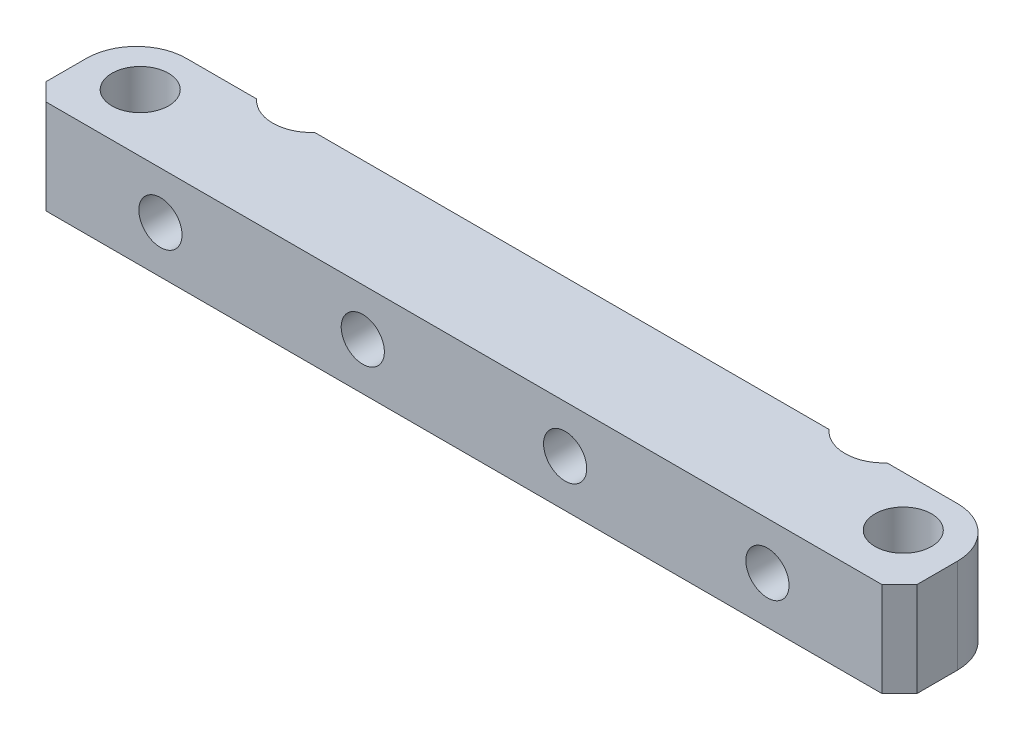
ISO-10303-21;
HEADER;
FILE_DESCRIPTION(('STEP AP214'),'2;1');
FILE_NAME('part.step','',(''),(''),'','','');
FILE_SCHEMA(('AUTOMOTIVE_DESIGN { 1 0 10303 214 1 1 1 1 }'));
ENDSEC;
DATA;
#1=APPLICATION_CONTEXT('core data for automotive mechanical design processes');
#2=APPLICATION_PROTOCOL_DEFINITION('international standard','automotive_design',2000,#1);
#3=PRODUCT_CONTEXT('',#1,'mechanical');
#4=PRODUCT('Part','Part','',(#3));
#5=PRODUCT_RELATED_PRODUCT_CATEGORY('part','',(#4));
#6=PRODUCT_DEFINITION_FORMATION('','',#4);
#7=PRODUCT_DEFINITION_CONTEXT('part definition',#1,'design');
#8=PRODUCT_DEFINITION('design','',#6,#7);
#9=PRODUCT_DEFINITION_SHAPE('','',#8);
#10=(LENGTH_UNIT() NAMED_UNIT(*) SI_UNIT(.MILLI.,.METRE.));
#11=(NAMED_UNIT(*) PLANE_ANGLE_UNIT() SI_UNIT($,.RADIAN.));
#12=(NAMED_UNIT(*) SI_UNIT($,.STERADIAN.) SOLID_ANGLE_UNIT());
#13=UNCERTAINTY_MEASURE_WITH_UNIT(LENGTH_MEASURE(1.E-05),#10,'distance_accuracy_value','');
#14=(GEOMETRIC_REPRESENTATION_CONTEXT(3) GLOBAL_UNCERTAINTY_ASSIGNED_CONTEXT((#13)) GLOBAL_UNIT_ASSIGNED_CONTEXT((#10,
#11,#12)) REPRESENTATION_CONTEXT('',''));
#15=CARTESIAN_POINT('',(0.,0.,0.));
#16=DIRECTION('',(0.,0.,1.));
#17=DIRECTION('',(1.,0.,0.));
#18=AXIS2_PLACEMENT_3D('',#15,#16,#17);
#19=CARTESIAN_POINT('',(-32.284271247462,7.,-32.));
#20=DIRECTION('',(0.,0.,1.));
#21=DIRECTION('',(1.,0.,0.));
#22=AXIS2_PLACEMENT_3D('',#19,#20,#21);
#23=PLANE('',#22);
#24=CARTESIAN_POINT('',(7.5,3.5,-32.));
#25=DIRECTION('',(0.,0.,1.));
#26=DIRECTION('',(1.,0.,0.));
#27=AXIS2_PLACEMENT_3D('',#24,#25,#26);
#28=CIRCLE('',#27,1.6);
#29=CARTESIAN_POINT('',(9.1,3.5,-32.));
#30=VERTEX_POINT('',#29);
#31=EDGE_CURVE('E238',#30,#30,#28,.T.);
#32=ORIENTED_EDGE('',*,*,#31,.T.);
#33=EDGE_LOOP('',(#32));
#34=FACE_BOUND('',#33,.T.);
#35=CARTESIAN_POINT('',(-7.5,3.5,-32.));
#36=DIRECTION('',(0.,0.,1.));
#37=DIRECTION('',(1.,0.,0.));
#38=AXIS2_PLACEMENT_3D('',#35,#36,#37);
#39=CIRCLE('',#38,1.6);
#40=CARTESIAN_POINT('',(-5.9,3.5,-32.));
#41=VERTEX_POINT('',#40);
#42=EDGE_CURVE('E246',#41,#41,#39,.T.);
#43=ORIENTED_EDGE('',*,*,#42,.T.);
#44=EDGE_LOOP('',(#43));
#45=FACE_BOUND('',#44,.T.);
#46=DIRECTION('',(-1.,0.,0.));
#47=VECTOR('',#46,1.);
#48=CARTESIAN_POINT('',(-32.284271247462,7.,-32.));
#49=LINE('',#48,#47);
#50=CARTESIAN_POINT('',(19.0586659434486,7.,-32.));
#51=VERTEX_POINT('',#50);
#52=CARTESIAN_POINT('',(-19.0586659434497,7.,-32.));
#53=VERTEX_POINT('',#52);
#54=EDGE_CURVE('E184',#51,#53,#49,.T.);
#55=ORIENTED_EDGE('',*,*,#54,.F.);
#56=DIRECTION('',(0.,-1.,0.));
#57=VECTOR('',#56,1.);
#58=CARTESIAN_POINT('',(19.0586659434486,7.,-32.));
#59=LINE('',#58,#57);
#60=CARTESIAN_POINT('',(19.0586659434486,0.,-32.));
#61=VERTEX_POINT('',#60);
#62=EDGE_CURVE('E156',#51,#61,#59,.T.);
#63=ORIENTED_EDGE('',*,*,#62,.T.);
#64=DIRECTION('',(-1.,0.,0.));
#65=VECTOR('',#64,1.);
#66=CARTESIAN_POINT('',(-32.284271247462,0.,-32.));
#67=LINE('',#66,#65);
#68=CARTESIAN_POINT('',(-19.0586659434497,0.,-32.));
#69=VERTEX_POINT('',#68);
#70=EDGE_CURVE('E296',#61,#69,#67,.T.);
#71=ORIENTED_EDGE('',*,*,#70,.T.);
#72=DIRECTION('',(0.,-1.,0.));
#73=VECTOR('',#72,1.);
#74=CARTESIAN_POINT('',(-19.0586659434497,7.,-32.));
#75=LINE('',#74,#73);
#76=EDGE_CURVE('E262',#69,#53,#75,.F.);
#77=ORIENTED_EDGE('',*,*,#76,.T.);
#78=EDGE_LOOP('',(#55,#63,#71,#77));
#79=FACE_BOUND('',#78,.T.);
#80=ADVANCED_FACE('F47',(#34,#45,#79),#23,.F.);
#81=CARTESIAN_POINT('',(-23.3677409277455,7.,-32.));
#82=VERTEX_POINT('',#81);
#83=CARTESIAN_POINT('',(-28.584271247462,7.,-32.));
#84=VERTEX_POINT('',#83);
#85=EDGE_CURVE('E186',#82,#84,#49,.T.);
#86=ORIENTED_EDGE('',*,*,#85,.F.);
#87=DIRECTION('',(0.,-1.,0.));
#88=VECTOR('',#87,1.);
#89=CARTESIAN_POINT('',(-23.3677409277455,7.,-32.));
#90=LINE('',#89,#88);
#91=CARTESIAN_POINT('',(-23.3677409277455,6.26713311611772,-32.));
#92=VERTEX_POINT('',#91);
#93=EDGE_CURVE('E276',#82,#92,#90,.T.);
#94=ORIENTED_EDGE('',*,*,#93,.T.);
#95=CARTESIAN_POINT('',(-22.5,3.5,-32.));
#96=DIRECTION('',(0.,0.,-1.));
#97=DIRECTION('',(-1.,0.,0.));
#98=AXIS2_PLACEMENT_3D('',#95,#96,#97);
#99=CIRCLE('',#98,2.9);
#100=CARTESIAN_POINT('',(-23.3677409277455,0.732866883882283,-32.));
#101=VERTEX_POINT('',#100);
#102=EDGE_CURVE('E261',#101,#92,#99,.T.);
#103=ORIENTED_EDGE('',*,*,#102,.F.);
#104=CARTESIAN_POINT('',(-23.3677409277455,0.,-32.));
#105=VERTEX_POINT('',#104);
#106=EDGE_CURVE('E70',#101,#105,#90,.T.);
#107=ORIENTED_EDGE('',*,*,#106,.T.);
#108=CARTESIAN_POINT('',(-28.584271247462,0.,-32.));
#109=VERTEX_POINT('',#108);
#110=EDGE_CURVE('E302',#105,#109,#67,.T.);
#111=ORIENTED_EDGE('',*,*,#110,.T.);
#112=DIRECTION('',(0.,-1.,0.));
#113=VECTOR('',#112,1.);
#114=CARTESIAN_POINT('',(-28.584271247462,7.,-32.));
#115=LINE('',#114,#113);
#116=EDGE_CURVE('E321',#109,#84,#115,.F.);
#117=ORIENTED_EDGE('',*,*,#116,.T.);
#118=EDGE_LOOP('',(#86,#94,#103,#107,#111,#117));
#119=FACE_BOUND('',#118,.T.);
#120=ADVANCED_FACE('F384',(#119),#23,.F.);
#121=CARTESIAN_POINT('',(22.5,3.5,-32.));
#122=DIRECTION('',(0.,0.,1.));
#123=DIRECTION('',(1.,0.,0.));
#124=AXIS2_PLACEMENT_3D('',#121,#122,#123);
#125=CYLINDRICAL_SURFACE('',#124,1.6);
#126=CARTESIAN_POINT('',(22.5,3.5,-24.));
#127=DIRECTION('',(0.,0.,1.));
#128=DIRECTION('',(1.,0.,0.));
#129=AXIS2_PLACEMENT_3D('',#126,#127,#128);
#130=CIRCLE('',#129,1.6);
#131=CARTESIAN_POINT('',(24.1,3.5,-24.));
#132=VERTEX_POINT('',#131);
#133=EDGE_CURVE('E234',#132,#132,#130,.T.);
#134=ORIENTED_EDGE('',*,*,#133,.T.);
#135=EDGE_LOOP('',(#134));
#136=FACE_BOUND('',#135,.T.);
#137=CARTESIAN_POINT('',(22.5,3.5,-28.5));
#138=DIRECTION('',(0.,0.,-1.));
#139=DIRECTION('',(-1.,0.,0.));
#140=AXIS2_PLACEMENT_3D('',#137,#138,#139);
#141=CIRCLE('',#140,1.6);
#142=CARTESIAN_POINT('',(20.9,3.5,-28.5));
#143=VERTEX_POINT('',#142);
#144=EDGE_CURVE('E239',#143,#143,#141,.F.);
#145=ORIENTED_EDGE('',*,*,#144,.F.);
#146=EDGE_LOOP('',(#145));
#147=FACE_BOUND('',#146,.T.);
#148=ADVANCED_FACE('F389',(#136,#147),#125,.F.);
#149=CARTESIAN_POINT('',(-22.5,3.5,-32.));
#150=DIRECTION('',(0.,0.,1.));
#151=DIRECTION('',(1.,0.,0.));
#152=AXIS2_PLACEMENT_3D('',#149,#150,#151);
#153=CYLINDRICAL_SURFACE('',#152,1.6);
#154=CARTESIAN_POINT('',(-22.5,3.5,-24.));
#155=DIRECTION('',(0.,0.,1.));
#156=DIRECTION('',(1.,0.,0.));
#157=AXIS2_PLACEMENT_3D('',#154,#155,#156);
#158=CIRCLE('',#157,1.6);
#159=CARTESIAN_POINT('',(-20.9,3.5,-24.));
#160=VERTEX_POINT('',#159);
#161=EDGE_CURVE('E230',#160,#160,#158,.T.);
#162=ORIENTED_EDGE('',*,*,#161,.T.);
#163=EDGE_LOOP('',(#162));
#164=FACE_BOUND('',#163,.T.);
#165=CARTESIAN_POINT('',(-22.5,3.5,-28.5));
#166=DIRECTION('',(0.,0.,-1.));
#167=DIRECTION('',(-1.,0.,0.));
#168=AXIS2_PLACEMENT_3D('',#165,#166,#167);
#169=CIRCLE('',#168,1.6);
#170=CARTESIAN_POINT('',(-24.1,3.5,-28.5));
#171=VERTEX_POINT('',#170);
#172=EDGE_CURVE('E272',#171,#171,#169,.F.);
#173=ORIENTED_EDGE('',*,*,#172,.F.);
#174=EDGE_LOOP('',(#173));
#175=FACE_BOUND('',#174,.T.);
#176=ADVANCED_FACE('F470',(#164,#175),#153,.F.);
#177=CARTESIAN_POINT('',(0.,7.,0.));
#178=DIRECTION('',(0.,1.,0.));
#179=DIRECTION('',(0.,0.,1.));
#180=AXIS2_PLACEMENT_3D('',#177,#178,#179);
#181=PLANE('',#180);
#182=CARTESIAN_POINT('',(21.2132034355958,7.,-33.9411254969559));
#183=DIRECTION('',(0.,-1.,0.));
#184=DIRECTION('',(0.,0.,-1.));
#185=AXIS2_PLACEMENT_3D('',#182,#183,#184);
#186=CIRCLE('',#185,2.9);
#187=CARTESIAN_POINT('',(23.367740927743,7.,-32.));
#188=VERTEX_POINT('',#187);
#189=EDGE_CURVE('E153',#188,#51,#186,.T.);
#190=ORIENTED_EDGE('',*,*,#189,.T.);
#191=ORIENTED_EDGE('',*,*,#54,.T.);
#192=CARTESIAN_POINT('',(-21.2132034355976,7.,-33.9411254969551));
#193=DIRECTION('',(0.,-1.,0.));
#194=DIRECTION('',(0.,0.,-1.));
#195=AXIS2_PLACEMENT_3D('',#192,#193,#194);
#196=CIRCLE('',#195,2.9);
#197=EDGE_CURVE('E281',#53,#82,#196,.T.);
#198=ORIENTED_EDGE('',*,*,#197,.T.);
#199=ORIENTED_EDGE('',*,*,#85,.T.);
#200=CARTESIAN_POINT('',(-28.584271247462,7.,-28.3));
#201=DIRECTION('',(0.,1.,0.));
#202=DIRECTION('',(0.,0.,1.));
#203=AXIS2_PLACEMENT_3D('',#200,#201,#202);
#204=CIRCLE('',#203,3.7);
#205=CARTESIAN_POINT('',(-32.284271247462,7.,-28.3));
#206=VERTEX_POINT('',#205);
#207=EDGE_CURVE('E326',#84,#206,#204,.T.);
#208=ORIENTED_EDGE('',*,*,#207,.T.);
#209=DIRECTION('',(0.,0.,1.));
#210=VECTOR('',#209,1.);
#211=CARTESIAN_POINT('',(-32.284271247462,7.,-32.));
#212=LINE('',#211,#210);
#213=CARTESIAN_POINT('',(-32.284271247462,7.,-25.3));
#214=VERTEX_POINT('',#213);
#215=EDGE_CURVE('E209',#206,#214,#212,.T.);
#216=ORIENTED_EDGE('',*,*,#215,.T.);
#217=DIRECTION('',(-0.707106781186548,0.,-0.707106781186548));
#218=VECTOR('',#217,1.);
#219=CARTESIAN_POINT('',(-3.49213562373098,7.,3.49213562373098));
#220=LINE('',#219,#218);
#221=CARTESIAN_POINT('',(-30.984271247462,7.,-24.));
#222=VERTEX_POINT('',#221);
#223=EDGE_CURVE('E348',#214,#222,#220,.F.);
#224=ORIENTED_EDGE('',*,*,#223,.T.);
#225=DIRECTION('',(1.,0.,0.));
#226=VECTOR('',#225,1.);
#227=CARTESIAN_POINT('',(-32.284271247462,7.,-24.));
#228=LINE('',#227,#226);
#229=CARTESIAN_POINT('',(30.9842712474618,7.,-24.));
#230=VERTEX_POINT('',#229);
#231=EDGE_CURVE('E202',#222,#230,#228,.T.);
#232=ORIENTED_EDGE('',*,*,#231,.T.);
#233=DIRECTION('',(-0.707106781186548,0.,0.707106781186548));
#234=VECTOR('',#233,1.);
#235=CARTESIAN_POINT('',(3.49213562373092,7.,3.49213562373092));
#236=LINE('',#235,#234);
#237=CARTESIAN_POINT('',(32.2842712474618,7.,-25.3));
#238=VERTEX_POINT('',#237);
#239=EDGE_CURVE('E345',#230,#238,#236,.F.);
#240=ORIENTED_EDGE('',*,*,#239,.T.);
#241=DIRECTION('',(0.,0.,-1.));
#242=VECTOR('',#241,1.);
#243=CARTESIAN_POINT('',(32.2842712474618,7.,-32.));
#244=LINE('',#243,#242);
#245=CARTESIAN_POINT('',(32.2842712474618,7.,-28.3));
#246=VERTEX_POINT('',#245);
#247=EDGE_CURVE('E195',#238,#246,#244,.T.);
#248=ORIENTED_EDGE('',*,*,#247,.T.);
#249=CARTESIAN_POINT('',(28.5842712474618,7.,-28.3));
#250=DIRECTION('',(0.,1.,0.));
#251=DIRECTION('',(0.,0.,1.));
#252=AXIS2_PLACEMENT_3D('',#249,#250,#251);
#253=CIRCLE('',#252,3.7);
#254=CARTESIAN_POINT('',(28.5842712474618,7.,-32.));
#255=VERTEX_POINT('',#254);
#256=EDGE_CURVE('E181',#246,#255,#253,.T.);
#257=ORIENTED_EDGE('',*,*,#256,.T.);
#258=EDGE_CURVE('E170',#255,#188,#49,.T.);
#259=ORIENTED_EDGE('',*,*,#258,.T.);
#260=EDGE_LOOP('',(#190,#191,#198,#199,#208,#216,#224,#232,#240,#248,#257,#259));
#261=FACE_BOUND('',#260,.T.);
#262=CARTESIAN_POINT('',(28.2842712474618,7.,-28.284271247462));
#263=DIRECTION('',(0.,1.,0.));
#264=DIRECTION('',(0.,0.,1.));
#265=AXIS2_PLACEMENT_3D('',#262,#263,#264);
#266=CIRCLE('',#265,2.1);
#267=CARTESIAN_POINT('',(28.2842712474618,7.,-26.184271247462));
#268=VERTEX_POINT('',#267);
#269=EDGE_CURVE('E220',#268,#268,#266,.T.);
#270=ORIENTED_EDGE('',*,*,#269,.F.);
#271=EDGE_LOOP('',(#270));
#272=FACE_BOUND('',#271,.T.);
#273=CARTESIAN_POINT('',(-28.284271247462,7.,-28.2842712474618));
#274=DIRECTION('',(0.,1.,0.));
#275=DIRECTION('',(0.,0.,1.));
#276=AXIS2_PLACEMENT_3D('',#273,#274,#275);
#277=CIRCLE('',#276,2.1);
#278=CARTESIAN_POINT('',(-28.284271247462,7.,-26.1842712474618));
#279=VERTEX_POINT('',#278);
#280=EDGE_CURVE('E221',#279,#279,#277,.T.);
#281=ORIENTED_EDGE('',*,*,#280,.F.);
#282=EDGE_LOOP('',(#281));
#283=FACE_BOUND('',#282,.T.);
#284=ADVANCED_FACE('F178',(#261,#272,#283),#181,.T.);
#285=CARTESIAN_POINT('',(0.,0.,0.));
#286=DIRECTION('',(0.,1.,0.));
#287=DIRECTION('',(0.,0.,1.));
#288=AXIS2_PLACEMENT_3D('',#285,#286,#287);
#289=PLANE('',#288);
#290=ORIENTED_EDGE('',*,*,#70,.F.);
#291=CARTESIAN_POINT('',(21.2132034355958,0.,-33.9411254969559));
#292=DIRECTION('',(0.,-1.,0.));
#293=DIRECTION('',(0.,0.,-1.));
#294=AXIS2_PLACEMENT_3D('',#291,#292,#293);
#295=CIRCLE('',#294,2.9);
#296=CARTESIAN_POINT('',(23.367740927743,0.,-32.));
#297=VERTEX_POINT('',#296);
#298=EDGE_CURVE('E162',#297,#61,#295,.T.);
#299=ORIENTED_EDGE('',*,*,#298,.F.);
#300=CARTESIAN_POINT('',(28.5842712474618,0.,-32.));
#301=VERTEX_POINT('',#300);
#302=EDGE_CURVE('E215',#301,#297,#67,.T.);
#303=ORIENTED_EDGE('',*,*,#302,.F.);
#304=CARTESIAN_POINT('',(28.5842712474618,0.,-28.3));
#305=DIRECTION('',(0.,1.,0.));
#306=DIRECTION('',(0.,0.,1.));
#307=AXIS2_PLACEMENT_3D('',#304,#305,#306);
#308=CIRCLE('',#307,3.7);
#309=CARTESIAN_POINT('',(32.2842712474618,0.,-28.3));
#310=VERTEX_POINT('',#309);
#311=EDGE_CURVE('E189',#301,#310,#308,.F.);
#312=ORIENTED_EDGE('',*,*,#311,.T.);
#313=DIRECTION('',(0.,0.,-1.));
#314=VECTOR('',#313,1.);
#315=CARTESIAN_POINT('',(32.2842712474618,0.,-32.));
#316=LINE('',#315,#314);
#317=CARTESIAN_POINT('',(32.2842712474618,0.,-25.3));
#318=VERTEX_POINT('',#317);
#319=EDGE_CURVE('E307',#318,#310,#316,.T.);
#320=ORIENTED_EDGE('',*,*,#319,.F.);
#321=DIRECTION('',(0.707106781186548,0.,-0.707106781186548));
#322=VECTOR('',#321,1.);
#323=CARTESIAN_POINT('',(32.2842712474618,0.,-25.3));
#324=LINE('',#323,#322);
#325=CARTESIAN_POINT('',(30.9842712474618,0.,-24.));
#326=VERTEX_POINT('',#325);
#327=EDGE_CURVE('E337',#318,#326,#324,.F.);
#328=ORIENTED_EDGE('',*,*,#327,.T.);
#329=DIRECTION('',(1.,0.,0.));
#330=VECTOR('',#329,1.);
#331=CARTESIAN_POINT('',(-32.284271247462,0.,-24.));
#332=LINE('',#331,#330);
#333=CARTESIAN_POINT('',(-30.984271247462,0.,-24.));
#334=VERTEX_POINT('',#333);
#335=EDGE_CURVE('E445',#334,#326,#332,.T.);
#336=ORIENTED_EDGE('',*,*,#335,.F.);
#337=DIRECTION('',(0.707106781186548,0.,0.707106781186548));
#338=VECTOR('',#337,1.);
#339=CARTESIAN_POINT('',(-30.984271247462,0.,-24.));
#340=LINE('',#339,#338);
#341=CARTESIAN_POINT('',(-32.284271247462,0.,-25.3));
#342=VERTEX_POINT('',#341);
#343=EDGE_CURVE('E340',#334,#342,#340,.F.);
#344=ORIENTED_EDGE('',*,*,#343,.T.);
#345=DIRECTION('',(0.,0.,1.));
#346=VECTOR('',#345,1.);
#347=CARTESIAN_POINT('',(-32.284271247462,0.,-32.));
#348=LINE('',#347,#346);
#349=CARTESIAN_POINT('',(-32.284271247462,0.,-28.3));
#350=VERTEX_POINT('',#349);
#351=EDGE_CURVE('E225',#350,#342,#348,.T.);
#352=ORIENTED_EDGE('',*,*,#351,.F.);
#353=CARTESIAN_POINT('',(-28.584271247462,0.,-28.3));
#354=DIRECTION('',(0.,1.,0.));
#355=DIRECTION('',(0.,0.,1.));
#356=AXIS2_PLACEMENT_3D('',#353,#354,#355);
#357=CIRCLE('',#356,3.7);
#358=EDGE_CURVE('E314',#350,#109,#357,.F.);
#359=ORIENTED_EDGE('',*,*,#358,.T.);
#360=ORIENTED_EDGE('',*,*,#110,.F.);
#361=CARTESIAN_POINT('',(-21.2132034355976,0.,-33.9411254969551));
#362=DIRECTION('',(0.,-1.,0.));
#363=DIRECTION('',(0.,0.,-1.));
#364=AXIS2_PLACEMENT_3D('',#361,#362,#363);
#365=CIRCLE('',#364,2.9);
#366=EDGE_CURVE('E284',#69,#105,#365,.T.);
#367=ORIENTED_EDGE('',*,*,#366,.F.);
#368=EDGE_LOOP('',(#290,#299,#303,#312,#320,#328,#336,#344,#352,#359,#360,#367));
#369=FACE_BOUND('',#368,.T.);
#370=CARTESIAN_POINT('',(28.2842712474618,0.,-28.284271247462));
#371=DIRECTION('',(0.,1.,0.));
#372=DIRECTION('',(0.,0.,1.));
#373=AXIS2_PLACEMENT_3D('',#370,#371,#372);
#374=CIRCLE('',#373,2.1);
#375=CARTESIAN_POINT('',(28.2842712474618,0.,-26.184271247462));
#376=VERTEX_POINT('',#375);
#377=EDGE_CURVE('E216',#376,#376,#374,.T.);
#378=ORIENTED_EDGE('',*,*,#377,.T.);
#379=EDGE_LOOP('',(#378));
#380=FACE_BOUND('',#379,.T.);
#381=CARTESIAN_POINT('',(-28.284271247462,0.,-28.2842712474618));
#382=DIRECTION('',(0.,1.,0.));
#383=DIRECTION('',(0.,0.,1.));
#384=AXIS2_PLACEMENT_3D('',#381,#382,#383);
#385=CIRCLE('',#384,2.1);
#386=CARTESIAN_POINT('',(-28.284271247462,0.,-26.1842712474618));
#387=VERTEX_POINT('',#386);
#388=EDGE_CURVE('E226',#387,#387,#385,.T.);
#389=ORIENTED_EDGE('',*,*,#388,.T.);
#390=EDGE_LOOP('',(#389));
#391=FACE_BOUND('',#390,.T.);
#392=ADVANCED_FACE('F298',(#369,#380,#391),#289,.F.);
#393=CARTESIAN_POINT('',(-32.284271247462,7.,-32.));
#394=DIRECTION('',(1.,0.,0.));
#395=DIRECTION('',(0.,0.,-1.));
#396=AXIS2_PLACEMENT_3D('',#393,#394,#395);
#397=PLANE('',#396);
#398=ORIENTED_EDGE('',*,*,#351,.T.);
#399=DIRECTION('',(0.,1.,0.));
#400=VECTOR('',#399,1.);
#401=CARTESIAN_POINT('',(-32.284271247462,7.,-25.3));
#402=LINE('',#401,#400);
#403=EDGE_CURVE('E343',#342,#214,#402,.T.);
#404=ORIENTED_EDGE('',*,*,#403,.T.);
#405=ORIENTED_EDGE('',*,*,#215,.F.);
#406=DIRECTION('',(0.,-1.,0.));
#407=VECTOR('',#406,1.);
#408=CARTESIAN_POINT('',(-32.284271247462,7.,-28.3));
#409=LINE('',#408,#407);
#410=EDGE_CURVE('E183',#206,#350,#409,.T.);
#411=ORIENTED_EDGE('',*,*,#410,.T.);
#412=EDGE_LOOP('',(#398,#404,#405,#411));
#413=FACE_BOUND('',#412,.T.);
#414=ADVANCED_FACE('F407',(#413),#397,.F.);
#415=CARTESIAN_POINT('',(-32.284271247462,7.,-24.));
#416=DIRECTION('',(0.,0.,-1.));
#417=DIRECTION('',(-1.,0.,0.));
#418=AXIS2_PLACEMENT_3D('',#415,#416,#417);
#419=PLANE('',#418);
#420=ORIENTED_EDGE('',*,*,#161,.F.);
#421=EDGE_LOOP('',(#420));
#422=FACE_BOUND('',#421,.T.);
#423=CARTESIAN_POINT('',(-7.5,3.5,-24.));
#424=DIRECTION('',(0.,0.,1.));
#425=DIRECTION('',(1.,0.,0.));
#426=AXIS2_PLACEMENT_3D('',#423,#424,#425);
#427=CIRCLE('',#426,1.6);
#428=CARTESIAN_POINT('',(-5.9,3.5,-24.));
#429=VERTEX_POINT('',#428);
#430=EDGE_CURVE('E250',#429,#429,#427,.T.);
#431=ORIENTED_EDGE('',*,*,#430,.F.);
#432=EDGE_LOOP('',(#431));
#433=FACE_BOUND('',#432,.T.);
#434=CARTESIAN_POINT('',(7.5,3.5,-24.));
#435=DIRECTION('',(0.,0.,1.));
#436=DIRECTION('',(1.,0.,0.));
#437=AXIS2_PLACEMENT_3D('',#434,#435,#436);
#438=CIRCLE('',#437,1.6);
#439=CARTESIAN_POINT('',(9.1,3.5,-24.));
#440=VERTEX_POINT('',#439);
#441=EDGE_CURVE('E242',#440,#440,#438,.T.);
#442=ORIENTED_EDGE('',*,*,#441,.F.);
#443=EDGE_LOOP('',(#442));
#444=FACE_BOUND('',#443,.T.);
#445=ORIENTED_EDGE('',*,*,#133,.F.);
#446=EDGE_LOOP('',(#445));
#447=FACE_BOUND('',#446,.T.);
#448=ORIENTED_EDGE('',*,*,#231,.F.);
#449=DIRECTION('',(0.,-1.,0.));
#450=VECTOR('',#449,1.);
#451=CARTESIAN_POINT('',(-30.984271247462,7.,-24.));
#452=LINE('',#451,#450);
#453=EDGE_CURVE('E333',#222,#334,#452,.T.);
#454=ORIENTED_EDGE('',*,*,#453,.T.);
#455=ORIENTED_EDGE('',*,*,#335,.T.);
#456=DIRECTION('',(0.,1.,0.));
#457=VECTOR('',#456,1.);
#458=CARTESIAN_POINT('',(30.9842712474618,7.,-24.));
#459=LINE('',#458,#457);
#460=EDGE_CURVE('E331',#326,#230,#459,.T.);
#461=ORIENTED_EDGE('',*,*,#460,.T.);
#462=EDGE_LOOP('',(#448,#454,#455,#461));
#463=FACE_BOUND('',#462,.T.);
#464=ADVANCED_FACE('F403',(#422,#433,#444,#447,#463),#419,.F.);
#465=CARTESIAN_POINT('',(32.2842712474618,7.,-32.));
#466=DIRECTION('',(-1.,0.,0.));
#467=DIRECTION('',(0.,0.,1.));
#468=AXIS2_PLACEMENT_3D('',#465,#466,#467);
#469=PLANE('',#468);
#470=ORIENTED_EDGE('',*,*,#247,.F.);
#471=DIRECTION('',(0.,-1.,0.));
#472=VECTOR('',#471,1.);
#473=CARTESIAN_POINT('',(32.2842712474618,7.,-25.3));
#474=LINE('',#473,#472);
#475=EDGE_CURVE('E351',#238,#318,#474,.T.);
#476=ORIENTED_EDGE('',*,*,#475,.T.);
#477=ORIENTED_EDGE('',*,*,#319,.T.);
#478=DIRECTION('',(0.,-1.,0.));
#479=VECTOR('',#478,1.);
#480=CARTESIAN_POINT('',(32.2842712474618,7.,-28.3));
#481=LINE('',#480,#479);
#482=EDGE_CURVE('E328',#310,#246,#481,.F.);
#483=ORIENTED_EDGE('',*,*,#482,.T.);
#484=EDGE_LOOP('',(#470,#476,#477,#483));
#485=FACE_BOUND('',#484,.T.);
#486=ADVANCED_FACE('F396',(#485),#469,.F.);
#487=ORIENTED_EDGE('',*,*,#302,.T.);
#488=DIRECTION('',(0.,-1.,0.));
#489=VECTOR('',#488,1.);
#490=CARTESIAN_POINT('',(23.367740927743,7.,-32.));
#491=LINE('',#490,#489);
#492=CARTESIAN_POINT('',(23.367740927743,0.73286688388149,-32.));
#493=VERTEX_POINT('',#492);
#494=EDGE_CURVE('E176',#297,#493,#491,.F.);
#495=ORIENTED_EDGE('',*,*,#494,.T.);
#496=CARTESIAN_POINT('',(22.5,3.5,-32.));
#497=DIRECTION('',(0.,0.,-1.));
#498=DIRECTION('',(-1.,0.,0.));
#499=AXIS2_PLACEMENT_3D('',#496,#497,#498);
#500=CIRCLE('',#499,2.9);
#501=CARTESIAN_POINT('',(23.367740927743,6.26713311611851,-32.));
#502=VERTEX_POINT('',#501);
#503=EDGE_CURVE('E174',#502,#493,#500,.T.);
#504=ORIENTED_EDGE('',*,*,#503,.F.);
#505=EDGE_CURVE('E77',#502,#188,#491,.F.);
#506=ORIENTED_EDGE('',*,*,#505,.T.);
#507=ORIENTED_EDGE('',*,*,#258,.F.);
#508=DIRECTION('',(0.,-1.,0.));
#509=VECTOR('',#508,1.);
#510=CARTESIAN_POINT('',(28.5842712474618,7.,-32.));
#511=LINE('',#510,#509);
#512=EDGE_CURVE('E318',#255,#301,#511,.T.);
#513=ORIENTED_EDGE('',*,*,#512,.T.);
#514=EDGE_LOOP('',(#487,#495,#504,#506,#507,#513));
#515=FACE_BOUND('',#514,.T.);
#516=ADVANCED_FACE('F168',(#515),#23,.F.);
#517=CARTESIAN_POINT('',(28.2842712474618,7.,-28.284271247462));
#518=DIRECTION('',(0.,-1.,0.));
#519=DIRECTION('',(0.,0.,-1.));
#520=AXIS2_PLACEMENT_3D('',#517,#518,#519);
#521=CYLINDRICAL_SURFACE('',#520,2.1);
#522=ORIENTED_EDGE('',*,*,#269,.T.);
#523=EDGE_LOOP('',(#522));
#524=FACE_BOUND('',#523,.T.);
#525=ORIENTED_EDGE('',*,*,#377,.F.);
#526=EDGE_LOOP('',(#525));
#527=FACE_BOUND('',#526,.T.);
#528=ADVANCED_FACE('F395',(#524,#527),#521,.F.);
#529=CARTESIAN_POINT('',(-28.284271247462,7.,-28.2842712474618));
#530=DIRECTION('',(0.,-1.,0.));
#531=DIRECTION('',(0.,0.,-1.));
#532=AXIS2_PLACEMENT_3D('',#529,#530,#531);
#533=CYLINDRICAL_SURFACE('',#532,2.1);
#534=ORIENTED_EDGE('',*,*,#280,.T.);
#535=EDGE_LOOP('',(#534));
#536=FACE_BOUND('',#535,.T.);
#537=ORIENTED_EDGE('',*,*,#388,.F.);
#538=EDGE_LOOP('',(#537));
#539=FACE_BOUND('',#538,.T.);
#540=ADVANCED_FACE('F400',(#536,#539),#533,.F.);
#541=CARTESIAN_POINT('',(-28.584271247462,7.,-28.3));
#542=DIRECTION('',(0.,-1.,0.));
#543=DIRECTION('',(0.,0.,-1.));
#544=AXIS2_PLACEMENT_3D('',#541,#542,#543);
#545=CYLINDRICAL_SURFACE('',#544,3.7);
#546=ORIENTED_EDGE('',*,*,#207,.F.);
#547=ORIENTED_EDGE('',*,*,#116,.F.);
#548=ORIENTED_EDGE('',*,*,#358,.F.);
#549=ORIENTED_EDGE('',*,*,#410,.F.);
#550=EDGE_LOOP('',(#546,#547,#548,#549));
#551=FACE_BOUND('',#550,.T.);
#552=ADVANCED_FACE('F414',(#551),#545,.T.);
#553=CARTESIAN_POINT('',(28.5842712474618,7.,-28.3));
#554=DIRECTION('',(0.,-1.,0.));
#555=DIRECTION('',(0.,0.,-1.));
#556=AXIS2_PLACEMENT_3D('',#553,#554,#555);
#557=CYLINDRICAL_SURFACE('',#556,3.7);
#558=ORIENTED_EDGE('',*,*,#256,.F.);
#559=ORIENTED_EDGE('',*,*,#482,.F.);
#560=ORIENTED_EDGE('',*,*,#311,.F.);
#561=ORIENTED_EDGE('',*,*,#512,.F.);
#562=EDGE_LOOP('',(#558,#559,#560,#561));
#563=FACE_BOUND('',#562,.T.);
#564=ADVANCED_FACE('F417',(#563),#557,.T.);
#565=CARTESIAN_POINT('',(7.5,3.5,-32.));
#566=DIRECTION('',(0.,0.,1.));
#567=DIRECTION('',(1.,0.,0.));
#568=AXIS2_PLACEMENT_3D('',#565,#566,#567);
#569=CYLINDRICAL_SURFACE('',#568,1.6);
#570=ORIENTED_EDGE('',*,*,#31,.F.);
#571=EDGE_LOOP('',(#570));
#572=FACE_BOUND('',#571,.T.);
#573=ORIENTED_EDGE('',*,*,#441,.T.);
#574=EDGE_LOOP('',(#573));
#575=FACE_BOUND('',#574,.T.);
#576=ADVANCED_FACE('F420',(#572,#575),#569,.F.);
#577=CARTESIAN_POINT('',(-7.5,3.5,-32.));
#578=DIRECTION('',(0.,0.,1.));
#579=DIRECTION('',(1.,0.,0.));
#580=AXIS2_PLACEMENT_3D('',#577,#578,#579);
#581=CYLINDRICAL_SURFACE('',#580,1.6);
#582=ORIENTED_EDGE('',*,*,#42,.F.);
#583=EDGE_LOOP('',(#582));
#584=FACE_BOUND('',#583,.T.);
#585=ORIENTED_EDGE('',*,*,#430,.T.);
#586=EDGE_LOOP('',(#585));
#587=FACE_BOUND('',#586,.T.);
#588=ADVANCED_FACE('F427',(#584,#587),#581,.F.);
#589=CARTESIAN_POINT('',(-30.984271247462,7.,-24.));
#590=DIRECTION('',(0.707106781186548,0.,-0.707106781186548));
#591=DIRECTION('',(0.,-1.,0.));
#592=AXIS2_PLACEMENT_3D('',#589,#590,#591);
#593=PLANE('',#592);
#594=ORIENTED_EDGE('',*,*,#223,.F.);
#595=ORIENTED_EDGE('',*,*,#403,.F.);
#596=ORIENTED_EDGE('',*,*,#343,.F.);
#597=ORIENTED_EDGE('',*,*,#453,.F.);
#598=EDGE_LOOP('',(#594,#595,#596,#597));
#599=FACE_BOUND('',#598,.T.);
#600=ADVANCED_FACE('F423',(#599),#593,.F.);
#601=CARTESIAN_POINT('',(32.2842712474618,7.,-25.3));
#602=DIRECTION('',(-0.707106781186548,0.,-0.707106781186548));
#603=DIRECTION('',(0.,-1.,0.));
#604=AXIS2_PLACEMENT_3D('',#601,#602,#603);
#605=PLANE('',#604);
#606=ORIENTED_EDGE('',*,*,#239,.F.);
#607=ORIENTED_EDGE('',*,*,#460,.F.);
#608=ORIENTED_EDGE('',*,*,#327,.F.);
#609=ORIENTED_EDGE('',*,*,#475,.F.);
#610=EDGE_LOOP('',(#606,#607,#608,#609));
#611=FACE_BOUND('',#610,.T.);
#612=ADVANCED_FACE('F50',(#611),#605,.F.);
#613=CARTESIAN_POINT('',(-22.5,3.5,-28.5));
#614=DIRECTION('',(0.,0.,-1.));
#615=DIRECTION('',(-1.,0.,0.));
#616=AXIS2_PLACEMENT_3D('',#613,#614,#615);
#617=PLANE('',#616);
#618=CARTESIAN_POINT('',(-22.5,3.5,-28.5));
#619=DIRECTION('',(0.,0.,-1.));
#620=DIRECTION('',(-1.,0.,0.));
#621=AXIS2_PLACEMENT_3D('',#618,#619,#620);
#622=CIRCLE('',#621,2.9);
#623=CARTESIAN_POINT('',(-25.4,3.5,-28.5));
#624=VERTEX_POINT('',#623);
#625=EDGE_CURVE('E257',#624,#624,#622,.T.);
#626=ORIENTED_EDGE('',*,*,#625,.T.);
#627=EDGE_LOOP('',(#626));
#628=FACE_BOUND('',#627,.T.);
#629=ORIENTED_EDGE('',*,*,#172,.T.);
#630=EDGE_LOOP('',(#629));
#631=FACE_BOUND('',#630,.T.);
#632=ADVANCED_FACE('F380',(#628,#631),#617,.T.);
#633=CARTESIAN_POINT('',(-22.5,3.5,-28.5));
#634=DIRECTION('',(0.,0.,-1.));
#635=DIRECTION('',(-1.,0.,0.));
#636=AXIS2_PLACEMENT_3D('',#633,#634,#635);
#637=CYLINDRICAL_SURFACE('',#636,2.9);
#638=ORIENTED_EDGE('',*,*,#625,.F.);
#639=EDGE_LOOP('',(#638));
#640=FACE_BOUND('',#639,.T.);
#641=ORIENTED_EDGE('',*,*,#102,.T.);
#642=CARTESIAN_POINT('',(-23.3677409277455,6.26713311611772,-32.));
#643=CARTESIAN_POINT('',(-23.3225254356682,6.28130702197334,-31.9498258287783));
#644=CARTESIAN_POINT('',(-23.275497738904,6.29484006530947,-31.9011452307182));
#645=CARTESIAN_POINT('',(-23.1778593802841,6.32011791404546,-31.8069385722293));
#646=CARTESIAN_POINT('',(-23.1272457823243,6.33186122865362,-31.7614151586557));
#647=CARTESIAN_POINT('',(-22.9695871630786,6.36373625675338,-31.6294359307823));
#648=CARTESIAN_POINT('',(-22.8572605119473,6.38033307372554,-31.5481694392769));
#649=CARTESIAN_POINT('',(-22.6800474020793,6.39502096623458,-31.4384734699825));
#650=CARTESIAN_POINT('',(-22.6192998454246,6.39820892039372,-31.4038449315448));
#651=CARTESIAN_POINT('',(-22.4954083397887,6.40065666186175,-31.3390446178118));
#652=CARTESIAN_POINT('',(-22.4322657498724,6.39991864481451,-31.308870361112));
#653=CARTESIAN_POINT('',(-22.304335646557,6.39409734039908,-31.2533241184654));
#654=CARTESIAN_POINT('',(-22.239554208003,6.38902831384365,-31.2279367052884));
#655=CARTESIAN_POINT('',(-22.1088337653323,6.37425215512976,-31.1820214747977));
#656=CARTESIAN_POINT('',(-22.04289492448,6.36454567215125,-31.1614929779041));
#657=CARTESIAN_POINT('',(-21.8580154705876,6.33060933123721,-31.1110574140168));
#658=CARTESIAN_POINT('',(-21.7384845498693,6.30096592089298,-31.0866110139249));
#659=CARTESIAN_POINT('',(-21.5022788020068,6.22579501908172,-31.0530949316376));
#660=CARTESIAN_POINT('',(-21.3856067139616,6.18025288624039,-31.0440394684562));
#661=CARTESIAN_POINT('',(-21.1638777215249,6.07664747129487,-31.0395155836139));
#662=CARTESIAN_POINT('',(-21.0585369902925,6.01920785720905,-31.0434788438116));
#663=CARTESIAN_POINT('',(-20.8564217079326,5.89226037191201,-31.0613660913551));
#664=CARTESIAN_POINT('',(-20.7596469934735,5.82275273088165,-31.0752898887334));
#665=CARTESIAN_POINT('',(-20.5642384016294,5.66349487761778,-31.1127014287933));
#666=CARTESIAN_POINT('',(-20.466989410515,5.57228865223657,-31.1371948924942));
#667=CARTESIAN_POINT('',(-20.2864823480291,5.37828067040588,-31.1915627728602));
#668=CARTESIAN_POINT('',(-20.2032412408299,5.27546510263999,-31.2214436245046));
#669=CARTESIAN_POINT('',(-20.0368988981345,5.03880567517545,-31.2886116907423));
#670=CARTESIAN_POINT('',(-19.9569628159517,4.90281330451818,-31.3262104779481));
#671=CARTESIAN_POINT('',(-19.8198035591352,4.61866057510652,-31.3966408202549));
#672=CARTESIAN_POINT('',(-19.7625701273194,4.47050574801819,-31.4294745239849));
#673=CARTESIAN_POINT('',(-19.6785274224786,4.18449598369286,-31.4800540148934));
#674=CARTESIAN_POINT('',(-19.6487492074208,4.04777183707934,-31.4991983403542));
#675=CARTESIAN_POINT('',(-19.6092456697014,3.77038297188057,-31.5249495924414));
#676=CARTESIAN_POINT('',(-19.5994934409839,3.62972379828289,-31.531573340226));
#677=CARTESIAN_POINT('',(-19.6005480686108,3.34833190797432,-31.5308678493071));
#678=CARTESIAN_POINT('',(-19.6113828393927,3.20759935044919,-31.5235196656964));
#679=CARTESIAN_POINT('',(-19.6530437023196,2.93031180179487,-31.4964396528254));
#680=CARTESIAN_POINT('',(-19.6838894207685,2.79376104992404,-31.4766956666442));
#681=CARTESIAN_POINT('',(-19.7643454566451,2.52757748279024,-31.4285590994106));
#682=CARTESIAN_POINT('',(-19.8140097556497,2.39796580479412,-31.4001416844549));
#683=CARTESIAN_POINT('',(-19.9308117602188,2.14783389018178,-31.339240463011));
#684=CARTESIAN_POINT('',(-19.9979652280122,2.02732198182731,-31.3067530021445));
#685=CARTESIAN_POINT('',(-20.1620485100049,1.77656742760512,-31.2366150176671));
#686=CARTESIAN_POINT('',(-20.262139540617,1.64834901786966,-31.1990628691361));
#687=CARTESIAN_POINT('',(-20.4836264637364,1.40938091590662,-31.1320219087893));
#688=CARTESIAN_POINT('',(-20.6049990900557,1.29861239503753,-31.1025243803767));
#689=CARTESIAN_POINT('',(-20.8380941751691,1.11993659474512,-31.063615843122));
#690=CARTESIAN_POINT('',(-20.9461831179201,1.04794590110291,-31.0512329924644));
#691=CARTESIAN_POINT('',(-21.1716079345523,0.918877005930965,-31.039234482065));
#692=CARTESIAN_POINT('',(-21.2889361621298,0.861786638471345,-31.0396083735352));
#693=CARTESIAN_POINT('',(-21.5300546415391,0.763904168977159,-31.0559442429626));
#694=CARTESIAN_POINT('',(-21.6538783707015,0.723208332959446,-31.0719964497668));
#695=CARTESIAN_POINT('',(-21.9025172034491,0.659318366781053,-31.1213947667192));
#696=CARTESIAN_POINT('',(-22.0273315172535,0.636111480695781,-31.1547282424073));
#697=CARTESIAN_POINT('',(-22.2619594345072,0.60758680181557,-31.2348191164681));
#698=CARTESIAN_POINT('',(-22.3721135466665,0.600849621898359,-31.2801021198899));
#699=CARTESIAN_POINT('',(-22.5862297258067,0.599299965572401,-31.3839788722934));
#700=CARTESIAN_POINT('',(-22.6901790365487,0.604511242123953,-31.4425989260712));
#701=CARTESIAN_POINT('',(-22.8975949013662,0.6253423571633,-31.5769519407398));
#702=CARTESIAN_POINT('',(-23.000324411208,0.641779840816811,-31.6536933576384));
#703=CARTESIAN_POINT('',(-23.1452098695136,0.67225574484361,-31.7774753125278));
#704=CARTESIAN_POINT('',(-23.1918933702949,0.683358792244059,-31.8200953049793));
#705=CARTESIAN_POINT('',(-23.282155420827,0.707079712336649,-31.9080499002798));
#706=CARTESIAN_POINT('',(-23.3257361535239,0.719696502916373,-31.9533825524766));
#707=CARTESIAN_POINT('',(-23.3677409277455,0.732866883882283,-32.));
#708=B_SPLINE_CURVE_WITH_KNOTS('',3,(#642,#643,#644,#645,#646,#647,#648,#649,#650,#651,#652,
#653,#654,#655,#656,#657,#658,#659,#660,#661,#662,#663,#664,#665,#666,#667,#668,#669,#670,#671,
#672,#673,#674,#675,#676,#677,#678,#679,#680,#681,#682,#683,#684,#685,#686,#687,#688,#689,#690,
#691,#692,#693,#694,#695,#696,#697,#698,#699,#700,#701,#702,#703,#704,#705,#706,#707),
.UNSPECIFIED.,.F.,.F.,(4,2,2,2,2,2,2,2,2,2,2,2,2,2,2,2,2,2,2,2,2,2,2,2,2,2,2,2,2,2,2,2,4),(0.,
0.206925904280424,0.414023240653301,0.830664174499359,1.04042298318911,1.2500644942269,
1.45901836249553,1.6679429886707,2.04244158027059,2.41728596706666,2.77598807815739,
3.13468334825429,3.53987155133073,3.94554697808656,4.42998789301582,4.91420968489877,
5.33607047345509,5.75736409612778,6.17922936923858,6.60150902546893,7.02500928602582,
7.44889255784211,7.94742943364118,8.44542464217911,8.8352127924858,9.22468168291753,
9.6164052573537,10.0078428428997,10.3641268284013,10.7211197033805,11.1073554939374,
11.2997723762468,11.4920525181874),.UNSPECIFIED.);
#709=EDGE_CURVE('E11',#92,#101,#708,.T.);
#710=ORIENTED_EDGE('',*,*,#709,.T.);
#711=EDGE_LOOP('',(#641,#710));
#712=FACE_BOUND('',#711,.T.);
#713=ADVANCED_FACE('F374',(#640,#712),#637,.F.);
#714=CARTESIAN_POINT('',(22.5,3.5,-28.5));
#715=DIRECTION('',(0.,0.,-1.));
#716=DIRECTION('',(-1.,0.,0.));
#717=AXIS2_PLACEMENT_3D('',#714,#715,#716);
#718=PLANE('',#717);
#719=CARTESIAN_POINT('',(22.5,3.5,-28.5));
#720=DIRECTION('',(0.,0.,-1.));
#721=DIRECTION('',(-1.,0.,0.));
#722=AXIS2_PLACEMENT_3D('',#719,#720,#721);
#723=CIRCLE('',#722,2.9);
#724=CARTESIAN_POINT('',(19.6,3.5,-28.5));
#725=VERTEX_POINT('',#724);
#726=EDGE_CURVE('E268',#725,#725,#723,.T.);
#727=ORIENTED_EDGE('',*,*,#726,.T.);
#728=EDGE_LOOP('',(#727));
#729=FACE_BOUND('',#728,.T.);
#730=ORIENTED_EDGE('',*,*,#144,.T.);
#731=EDGE_LOOP('',(#730));
#732=FACE_BOUND('',#731,.T.);
#733=ADVANCED_FACE('F372',(#729,#732),#718,.T.);
#734=CARTESIAN_POINT('',(22.5,3.5,-28.5));
#735=DIRECTION('',(0.,0.,-1.));
#736=DIRECTION('',(-1.,0.,0.));
#737=AXIS2_PLACEMENT_3D('',#734,#735,#736);
#738=CYLINDRICAL_SURFACE('',#737,2.9);
#739=ORIENTED_EDGE('',*,*,#726,.F.);
#740=EDGE_LOOP('',(#739));
#741=FACE_BOUND('',#740,.T.);
#742=ORIENTED_EDGE('',*,*,#503,.T.);
#743=CARTESIAN_POINT('',(23.367740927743,0.73286688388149,-32.));
#744=CARTESIAN_POINT('',(23.3225254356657,0.718692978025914,-31.9498258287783));
#745=CARTESIAN_POINT('',(23.2754977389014,0.705159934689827,-31.9011452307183));
#746=CARTESIAN_POINT('',(23.1778593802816,0.679882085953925,-31.8069385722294));
#747=CARTESIAN_POINT('',(23.1272457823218,0.668138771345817,-31.7614151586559));
#748=CARTESIAN_POINT('',(22.969587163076,0.636263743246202,-31.6294359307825));
#749=CARTESIAN_POINT('',(22.8572605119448,0.619666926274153,-31.5481694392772));
#750=CARTESIAN_POINT('',(22.6800474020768,0.60497903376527,-31.4384734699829));
#751=CARTESIAN_POINT('',(22.6192998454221,0.601791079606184,-31.4038449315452));
#752=CARTESIAN_POINT('',(22.4954083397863,0.599343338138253,-31.3390446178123));
#753=CARTESIAN_POINT('',(22.43226574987,0.600081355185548,-31.3088703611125));
#754=CARTESIAN_POINT('',(22.3043356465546,0.605902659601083,-31.253324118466));
#755=CARTESIAN_POINT('',(22.2395542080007,0.610971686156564,-31.227936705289));
#756=CARTESIAN_POINT('',(22.10883376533,0.62574784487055,-31.1820214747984));
#757=CARTESIAN_POINT('',(22.0428949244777,0.635454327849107,-31.1614929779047));
#758=CARTESIAN_POINT('',(21.8580154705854,0.669390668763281,-31.1110574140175));
#759=CARTESIAN_POINT('',(21.7384845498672,0.699034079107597,-31.0866110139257));
#760=CARTESIAN_POINT('',(21.5022788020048,0.77420498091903,-31.0530949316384));
#761=CARTESIAN_POINT('',(21.3856067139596,0.819747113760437,-31.0440394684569));
#762=CARTESIAN_POINT('',(21.163877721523,0.923352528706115,-31.0395155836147));
#763=CARTESIAN_POINT('',(21.0585369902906,0.980792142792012,-31.0434788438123));
#764=CARTESIAN_POINT('',(20.8564217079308,1.10773962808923,-31.0613660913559));
#765=CARTESIAN_POINT('',(20.7596469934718,1.17724726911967,-31.0752898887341));
#766=CARTESIAN_POINT('',(20.5642384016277,1.33650512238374,-31.112701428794));
#767=CARTESIAN_POINT('',(20.4669894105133,1.42771134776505,-31.137194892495));
#768=CARTESIAN_POINT('',(20.2864823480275,1.62171932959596,-31.1915627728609));
#769=CARTESIAN_POINT('',(20.2032412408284,1.72453489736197,-31.2214436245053));
#770=CARTESIAN_POINT('',(20.0368988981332,1.96119432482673,-31.2886116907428));
#771=CARTESIAN_POINT('',(19.9569628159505,2.09718669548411,-31.3262104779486));
#772=CARTESIAN_POINT('',(19.8198035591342,2.381339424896,-31.3966408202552));
#773=CARTESIAN_POINT('',(19.7625701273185,2.52949425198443,-31.4294745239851));
#774=CARTESIAN_POINT('',(19.6785274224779,2.81550401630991,-31.4800540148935));
#775=CARTESIAN_POINT('',(19.6487492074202,2.95222816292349,-31.4991983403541));
#776=CARTESIAN_POINT('',(19.6092456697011,3.22961702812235,-31.5249495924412));
#777=CARTESIAN_POINT('',(19.5994934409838,3.37027620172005,-31.5315733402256));
#778=CARTESIAN_POINT('',(19.600548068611,3.65166809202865,-31.5308678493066));
#779=CARTESIAN_POINT('',(19.611382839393,3.79240064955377,-31.5235196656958));
#780=CARTESIAN_POINT('',(19.6530437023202,4.06968819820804,-31.4964396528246));
#781=CARTESIAN_POINT('',(19.6838894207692,4.20623895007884,-31.4766956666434));
#782=CARTESIAN_POINT('',(19.7643454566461,4.47242251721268,-31.4285590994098));
#783=CARTESIAN_POINT('',(19.8140097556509,4.60203419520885,-31.4001416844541));
#784=CARTESIAN_POINT('',(19.9308117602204,4.85216610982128,-31.3392404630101));
#785=CARTESIAN_POINT('',(19.997965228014,4.97267801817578,-31.3067530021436));
#786=CARTESIAN_POINT('',(20.1620485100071,5.22343257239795,-31.2366150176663));
#787=CARTESIAN_POINT('',(20.2621395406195,5.35165098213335,-31.1990628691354));
#788=CARTESIAN_POINT('',(20.4836264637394,5.59061908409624,-31.1320219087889));
#789=CARTESIAN_POINT('',(20.6049990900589,5.70138760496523,-31.1025243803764));
#790=CARTESIAN_POINT('',(20.8380941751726,5.8800634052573,-31.0636158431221));
#791=CARTESIAN_POINT('',(20.9461831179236,5.95205409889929,-31.0512329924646));
#792=CARTESIAN_POINT('',(21.1716079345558,6.08112299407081,-31.0392344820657));
#793=CARTESIAN_POINT('',(21.2889361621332,6.13821336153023,-31.0396083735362));
#794=CARTESIAN_POINT('',(21.5300546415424,6.23609583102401,-31.0559442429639));
#795=CARTESIAN_POINT('',(21.6538783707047,6.27679166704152,-31.0719964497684));
#796=CARTESIAN_POINT('',(21.902517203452,6.34068163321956,-31.1213947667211));
#797=CARTESIAN_POINT('',(22.0273315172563,6.36388851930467,-31.1547282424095));
#798=CARTESIAN_POINT('',(22.2619594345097,6.39241319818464,-31.2348191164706));
#799=CARTESIAN_POINT('',(22.372113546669,6.39915037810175,-31.2801021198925));
#800=CARTESIAN_POINT('',(22.586229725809,6.40070003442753,-31.3839788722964));
#801=CARTESIAN_POINT('',(22.6901790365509,6.3954887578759,-31.4425989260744));
#802=CARTESIAN_POINT('',(22.8975949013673,6.37465764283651,-31.5769519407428));
#803=CARTESIAN_POINT('',(23.0003244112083,6.35822015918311,-31.6536933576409));
#804=CARTESIAN_POINT('',(23.1452098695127,6.32774425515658,-31.7774753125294));
#805=CARTESIAN_POINT('',(23.1918933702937,6.31664120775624,-31.8200953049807));
#806=CARTESIAN_POINT('',(23.282155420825,6.29292028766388,-31.9080499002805));
#807=CARTESIAN_POINT('',(23.3257361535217,6.28030349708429,-31.953382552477));
#808=CARTESIAN_POINT('',(23.367740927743,6.26713311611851,-32.));
#809=B_SPLINE_CURVE_WITH_KNOTS('',3,(#743,#744,#745,#746,#747,#748,#749,#750,#751,#752,#753,
#754,#755,#756,#757,#758,#759,#760,#761,#762,#763,#764,#765,#766,#767,#768,#769,#770,#771,#772,
#773,#774,#775,#776,#777,#778,#779,#780,#781,#782,#783,#784,#785,#786,#787,#788,#789,#790,#791,
#792,#793,#794,#795,#796,#797,#798,#799,#800,#801,#802,#803,#804,#805,#806,#807,#808),
.UNSPECIFIED.,.F.,.F.,(4,2,2,2,2,2,2,2,2,2,2,2,2,2,2,2,2,2,2,2,2,2,2,2,2,2,2,2,2,2,2,2,4),(0.,
0.206925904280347,0.414023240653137,0.830664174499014,1.04042298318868,1.25006449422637,
1.4590183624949,1.66794298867,2.04244158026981,2.4172859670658,2.77598807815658,
3.13468334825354,3.53987155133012,3.94554697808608,4.42998789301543,4.91420968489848,
5.33607047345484,5.75736409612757,6.17922936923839,6.60150902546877,7.02500928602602,
7.44889255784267,7.94742943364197,8.44542464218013,8.83521279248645,9.22468168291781,
9.61640525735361,10.0078428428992,10.3641268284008,10.72111970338,11.1073554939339,
11.299772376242,11.492052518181),.UNSPECIFIED.);
#810=EDGE_CURVE('E63',#493,#502,#809,.T.);
#811=ORIENTED_EDGE('',*,*,#810,.T.);
#812=EDGE_LOOP('',(#742,#811));
#813=FACE_BOUND('',#812,.T.);
#814=ADVANCED_FACE('F364',(#741,#813),#738,.F.);
#815=CARTESIAN_POINT('',(21.2132034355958,7.,-33.9411254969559));
#816=DIRECTION('',(0.,-1.,0.));
#817=DIRECTION('',(0.,0.,-1.));
#818=AXIS2_PLACEMENT_3D('',#815,#816,#817);
#819=CYLINDRICAL_SURFACE('',#818,2.9);
#820=ORIENTED_EDGE('',*,*,#189,.F.);
#821=ORIENTED_EDGE('',*,*,#505,.F.);
#822=ORIENTED_EDGE('',*,*,#810,.F.);
#823=ORIENTED_EDGE('',*,*,#494,.F.);
#824=ORIENTED_EDGE('',*,*,#298,.T.);
#825=ORIENTED_EDGE('',*,*,#62,.F.);
#826=EDGE_LOOP('',(#820,#821,#822,#823,#824,#825));
#827=FACE_BOUND('',#826,.T.);
#828=ADVANCED_FACE('F154',(#827),#819,.F.);
#829=CARTESIAN_POINT('',(-21.2132034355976,7.,-33.9411254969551));
#830=DIRECTION('',(0.,-1.,0.));
#831=DIRECTION('',(0.,0.,-1.));
#832=AXIS2_PLACEMENT_3D('',#829,#830,#831);
#833=CYLINDRICAL_SURFACE('',#832,2.9);
#834=ORIENTED_EDGE('',*,*,#366,.T.);
#835=ORIENTED_EDGE('',*,*,#106,.F.);
#836=ORIENTED_EDGE('',*,*,#709,.F.);
#837=ORIENTED_EDGE('',*,*,#93,.F.);
#838=ORIENTED_EDGE('',*,*,#197,.F.);
#839=ORIENTED_EDGE('',*,*,#76,.F.);
#840=EDGE_LOOP('',(#834,#835,#836,#837,#838,#839));
#841=FACE_BOUND('',#840,.T.);
#842=ADVANCED_FACE('F369',(#841),#833,.F.);
#843=CLOSED_SHELL('',(#80,#120,#148,#176,#284,#392,#414,#464,#486,#516,#528,#540,#552,#564,#576,
#588,#600,#612,#632,#713,#733,#814,#828,#842));
#844=MANIFOLD_SOLID_BREP('B2',#843);
#845=ADVANCED_BREP_SHAPE_REPRESENTATION('',(#18,#844),#14);
#846=SHAPE_DEFINITION_REPRESENTATION(#9,#845);
ENDSEC;
END-ISO-10303-21;
